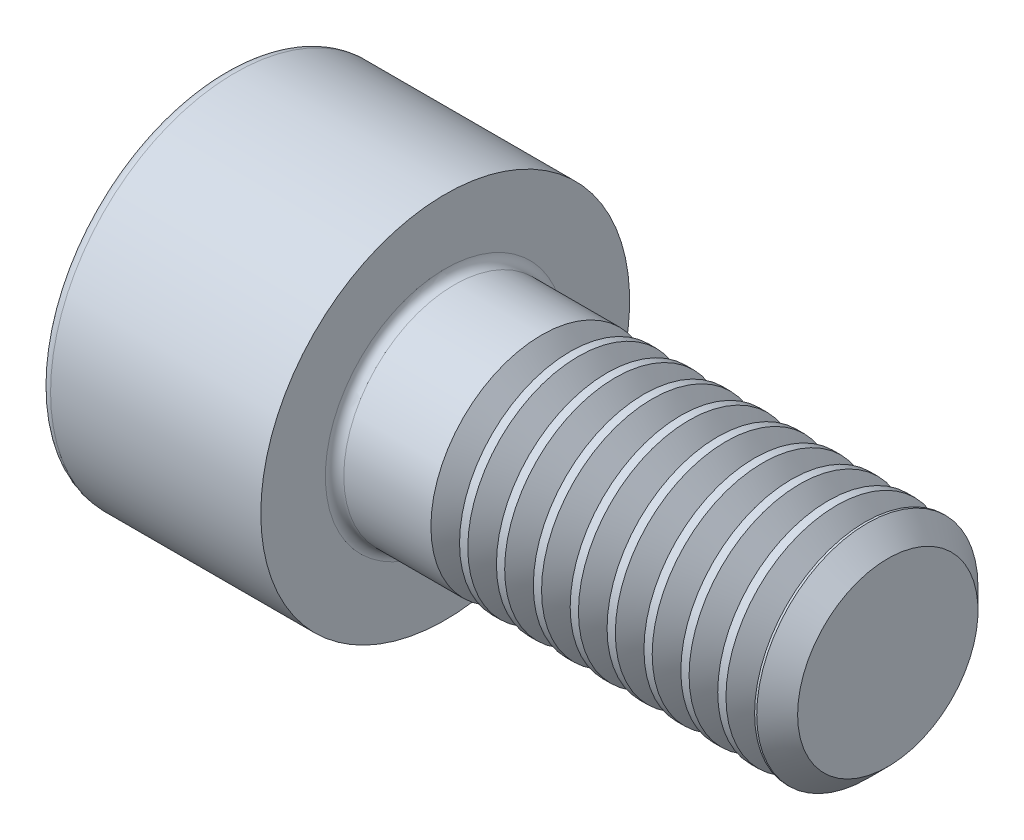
ISO-10303-21;
HEADER;
FILE_DESCRIPTION(('STEP AP214'),'2;1');
FILE_NAME('part.step','',(''),(''),'','','');
FILE_SCHEMA(('AUTOMOTIVE_DESIGN { 1 0 10303 214 1 1 1 1 }'));
ENDSEC;
DATA;
#1=APPLICATION_CONTEXT('core data for automotive mechanical design processes');
#2=APPLICATION_PROTOCOL_DEFINITION('international standard','automotive_design',2000,#1);
#3=PRODUCT_CONTEXT('',#1,'mechanical');
#4=PRODUCT('Part','Part','',(#3));
#5=PRODUCT_RELATED_PRODUCT_CATEGORY('part','',(#4));
#6=PRODUCT_DEFINITION_FORMATION('','',#4);
#7=PRODUCT_DEFINITION_CONTEXT('part definition',#1,'design');
#8=PRODUCT_DEFINITION('design','',#6,#7);
#9=PRODUCT_DEFINITION_SHAPE('','',#8);
#10=(LENGTH_UNIT() NAMED_UNIT(*) SI_UNIT(.MILLI.,.METRE.));
#11=(NAMED_UNIT(*) PLANE_ANGLE_UNIT() SI_UNIT($,.RADIAN.));
#12=(NAMED_UNIT(*) SI_UNIT($,.STERADIAN.) SOLID_ANGLE_UNIT());
#13=UNCERTAINTY_MEASURE_WITH_UNIT(LENGTH_MEASURE(1.E-05),#10,'distance_accuracy_value','');
#14=(GEOMETRIC_REPRESENTATION_CONTEXT(3) GLOBAL_UNCERTAINTY_ASSIGNED_CONTEXT((#13)) GLOBAL_UNIT_ASSIGNED_CONTEXT((#10,
#11,#12)) REPRESENTATION_CONTEXT('',''));
#15=CARTESIAN_POINT('',(0.,0.,0.));
#16=DIRECTION('',(0.,0.,1.));
#17=DIRECTION('',(1.,0.,0.));
#18=AXIS2_PLACEMENT_3D('',#15,#16,#17);
#19=CARTESIAN_POINT('',(0.,0.,0.));
#20=DIRECTION('',(-1.,0.,0.));
#21=DIRECTION('',(0.,0.,1.));
#22=AXIS2_PLACEMENT_3D('',#19,#20,#21);
#23=PLANE('',#22);
#24=DIRECTION('',(0.,-0.499999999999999,0.866025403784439));
#25=VECTOR('',#24,1.);
#26=CARTESIAN_POINT('',(0.,2.93524876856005,0.));
#27=LINE('',#26,#25);
#28=CARTESIAN_POINT('',(0.,2.93524876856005,0.));
#29=VERTEX_POINT('',#28);
#30=CARTESIAN_POINT('',(0.,1.46762438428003,2.542));
#31=VERTEX_POINT('',#30);
#32=EDGE_CURVE('E390',#29,#31,#27,.T.);
#33=ORIENTED_EDGE('',*,*,#32,.T.);
#34=DIRECTION('',(0.,1.,0.));
#35=VECTOR('',#34,1.);
#36=CARTESIAN_POINT('',(0.,-1.46762438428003,2.542));
#37=LINE('',#36,#35);
#38=CARTESIAN_POINT('',(0.,-1.46762438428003,2.542));
#39=VERTEX_POINT('',#38);
#40=EDGE_CURVE('E131',#39,#31,#37,.T.);
#41=ORIENTED_EDGE('',*,*,#40,.F.);
#42=DIRECTION('',(0.,-0.500000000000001,-0.866025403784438));
#43=VECTOR('',#42,1.);
#44=CARTESIAN_POINT('',(0.,-1.46762438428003,2.542));
#45=LINE('',#44,#43);
#46=CARTESIAN_POINT('',(0.,-2.93524876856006,0.));
#47=VERTEX_POINT('',#46);
#48=EDGE_CURVE('E409',#39,#47,#45,.T.);
#49=ORIENTED_EDGE('',*,*,#48,.T.);
#50=DIRECTION('',(0.,0.499999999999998,-0.866025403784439));
#51=VECTOR('',#50,1.);
#52=CARTESIAN_POINT('',(0.,-2.93524876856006,0.));
#53=LINE('',#52,#51);
#54=CARTESIAN_POINT('',(0.,-1.46762438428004,-2.542));
#55=VERTEX_POINT('',#54);
#56=EDGE_CURVE('E412',#47,#55,#53,.T.);
#57=ORIENTED_EDGE('',*,*,#56,.T.);
#58=DIRECTION('',(0.,-1.,0.));
#59=VECTOR('',#58,1.);
#60=CARTESIAN_POINT('',(0.,1.46762438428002,-2.542));
#61=LINE('',#60,#59);
#62=CARTESIAN_POINT('',(0.,1.46762438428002,-2.542));
#63=VERTEX_POINT('',#62);
#64=EDGE_CURVE('E415',#63,#55,#61,.T.);
#65=ORIENTED_EDGE('',*,*,#64,.F.);
#66=DIRECTION('',(0.,-0.500000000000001,-0.866025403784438));
#67=VECTOR('',#66,1.);
#68=CARTESIAN_POINT('',(0.,2.93524876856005,0.));
#69=LINE('',#68,#67);
#70=EDGE_CURVE('E126',#29,#63,#69,.T.);
#71=ORIENTED_EDGE('',*,*,#70,.F.);
#72=EDGE_LOOP('',(#33,#41,#49,#57,#65,#71));
#73=FACE_BOUND('',#72,.T.);
#74=CARTESIAN_POINT('',(0.,0.,0.));
#75=DIRECTION('',(-1.,0.,0.));
#76=DIRECTION('',(0.,0.,1.));
#77=AXIS2_PLACEMENT_3D('',#74,#75,#76);
#78=CIRCLE('',#77,4.7);
#79=CARTESIAN_POINT('',(0.,0.,4.7));
#80=VERTEX_POINT('',#79);
#81=EDGE_CURVE('E43',#80,#80,#78,.T.);
#82=ORIENTED_EDGE('',*,*,#81,.T.);
#83=EDGE_LOOP('',(#82));
#84=FACE_BOUND('',#83,.T.);
#85=ADVANCED_FACE('F35',(#73,#84),#23,.T.);
#86=CARTESIAN_POINT('',(-31.75,0.,0.));
#87=DIRECTION('',(-1.,0.,0.));
#88=DIRECTION('',(0.,0.,1.));
#89=AXIS2_PLACEMENT_3D('',#86,#87,#88);
#90=CYLINDRICAL_SURFACE('',#89,5.);
#91=CARTESIAN_POINT('',(0.300000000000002,0.,0.));
#92=DIRECTION('',(-1.,0.,0.));
#93=DIRECTION('',(0.,0.,1.));
#94=AXIS2_PLACEMENT_3D('',#91,#92,#93);
#95=CIRCLE('',#94,5.);
#96=CARTESIAN_POINT('',(0.300000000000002,0.,5.));
#97=VERTEX_POINT('',#96);
#98=EDGE_CURVE('E11',#97,#97,#95,.F.);
#99=ORIENTED_EDGE('',*,*,#98,.T.);
#100=EDGE_LOOP('',(#99));
#101=FACE_BOUND('',#100,.T.);
#102=CARTESIAN_POINT('',(6.,0.,0.));
#103=DIRECTION('',(-1.,0.,0.));
#104=DIRECTION('',(0.,0.,1.));
#105=AXIS2_PLACEMENT_3D('',#102,#103,#104);
#106=CIRCLE('',#105,5.);
#107=CARTESIAN_POINT('',(6.,0.,5.));
#108=VERTEX_POINT('',#107);
#109=EDGE_CURVE('E149',#108,#108,#106,.T.);
#110=ORIENTED_EDGE('',*,*,#109,.T.);
#111=EDGE_LOOP('',(#110));
#112=FACE_BOUND('',#111,.T.);
#113=ADVANCED_FACE('F173',(#101,#112),#90,.T.);
#114=CARTESIAN_POINT('',(6.,5.,0.));
#115=DIRECTION('',(1.,0.,0.));
#116=DIRECTION('',(0.,0.,-1.));
#117=AXIS2_PLACEMENT_3D('',#114,#115,#116);
#118=PLANE('',#117);
#119=CARTESIAN_POINT('',(6.,0.,0.));
#120=DIRECTION('',(1.,0.,0.));
#121=DIRECTION('',(0.,0.,-1.));
#122=AXIS2_PLACEMENT_3D('',#119,#120,#121);
#123=CIRCLE('',#122,3.24999999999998);
#124=CARTESIAN_POINT('',(6.,0.,-3.24999999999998));
#125=VERTEX_POINT('',#124);
#126=EDGE_CURVE('E152',#125,#125,#123,.F.);
#127=ORIENTED_EDGE('',*,*,#126,.T.);
#128=EDGE_LOOP('',(#127));
#129=FACE_BOUND('',#128,.T.);
#130=ORIENTED_EDGE('',*,*,#109,.F.);
#131=EDGE_LOOP('',(#130));
#132=FACE_BOUND('',#131,.T.);
#133=ADVANCED_FACE('F179',(#129,#132),#118,.T.);
#134=CARTESIAN_POINT('',(-31.75,0.,0.));
#135=DIRECTION('',(-1.,0.,0.));
#136=DIRECTION('',(0.,0.,1.));
#137=AXIS2_PLACEMENT_3D('',#134,#135,#136);
#138=CYLINDRICAL_SURFACE('',#137,2.99999999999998);
#139=CARTESIAN_POINT('',(8.61173492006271,0.,0.));
#140=DIRECTION('',(-1.,0.,0.));
#141=DIRECTION('',(0.,-1.,0.));
#142=AXIS2_PLACEMENT_3D('',#139,#140,#141);
#143=CIRCLE('',#142,3.);
#144=CARTESIAN_POINT('',(8.61173492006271,-3.,0.));
#145=VERTEX_POINT('',#144);
#146=EDGE_CURVE('E385',#145,#145,#143,.T.);
#147=ORIENTED_EDGE('',*,*,#146,.T.);
#148=EDGE_LOOP('',(#147));
#149=FACE_BOUND('',#148,.T.);
#150=CARTESIAN_POINT('',(6.25,0.,0.));
#151=DIRECTION('',(1.,0.,0.));
#152=DIRECTION('',(0.,0.,-1.));
#153=AXIS2_PLACEMENT_3D('',#150,#151,#152);
#154=CIRCLE('',#153,2.99999999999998);
#155=CARTESIAN_POINT('',(6.25,0.,-2.99999999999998));
#156=VERTEX_POINT('',#155);
#157=EDGE_CURVE('E155',#156,#156,#154,.T.);
#158=ORIENTED_EDGE('',*,*,#157,.T.);
#159=EDGE_LOOP('',(#158));
#160=FACE_BOUND('',#159,.T.);
#161=ADVANCED_FACE('F169',(#149,#160),#138,.T.);
#162=CARTESIAN_POINT('',(6.25,0.,0.));
#163=DIRECTION('',(1.,0.,0.));
#164=DIRECTION('',(0.,0.,-1.));
#165=AXIS2_PLACEMENT_3D('',#162,#163,#164);
#166=TOROIDAL_SURFACE('',#165,3.24999999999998,0.25);
#167=ORIENTED_EDGE('',*,*,#157,.F.);
#168=EDGE_LOOP('',(#167));
#169=FACE_BOUND('',#168,.T.);
#170=ORIENTED_EDGE('',*,*,#126,.F.);
#171=EDGE_LOOP('',(#170));
#172=FACE_BOUND('',#171,.T.);
#173=ADVANCED_FACE('F162',(#169,#172),#166,.F.);
#174=CARTESIAN_POINT('',(0.300000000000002,0.,0.));
#175=DIRECTION('',(-1.,0.,0.));
#176=DIRECTION('',(0.,0.,1.));
#177=AXIS2_PLACEMENT_3D('',#174,#175,#176);
#178=TOROIDAL_SURFACE('',#177,4.7,0.3);
#179=ORIENTED_EDGE('',*,*,#98,.F.);
#180=EDGE_LOOP('',(#179));
#181=FACE_BOUND('',#180,.T.);
#182=ORIENTED_EDGE('',*,*,#81,.F.);
#183=EDGE_LOOP('',(#182));
#184=FACE_BOUND('',#183,.T.);
#185=ADVANCED_FACE('F37',(#181,#184),#178,.T.);
#186=CARTESIAN_POINT('',(3.,2.93524876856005,0.));
#187=DIRECTION('',(0.,-0.866025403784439,-0.499999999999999));
#188=DIRECTION('',(0.,0.499999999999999,-0.866025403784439));
#189=AXIS2_PLACEMENT_3D('',#186,#187,#188);
#190=PLANE('',#189);
#191=ORIENTED_EDGE('',*,*,#32,.F.);
#192=DIRECTION('',(-1.,0.,0.));
#193=VECTOR('',#192,1.);
#194=CARTESIAN_POINT('',(3.,2.93524876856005,0.));
#195=LINE('',#194,#193);
#196=CARTESIAN_POINT('',(3.,2.93524876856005,0.));
#197=VERTEX_POINT('',#196);
#198=EDGE_CURVE('E406',#197,#29,#195,.T.);
#199=ORIENTED_EDGE('',*,*,#198,.F.);
#200=DIRECTION('',(0.,-0.499999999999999,0.866025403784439));
#201=VECTOR('',#200,1.);
#202=CARTESIAN_POINT('',(3.,2.93524876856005,0.));
#203=LINE('',#202,#201);
#204=CARTESIAN_POINT('',(3.,2.20143657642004,1.27099999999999));
#205=VERTEX_POINT('',#204);
#206=EDGE_CURVE('E118',#197,#205,#203,.T.);
#207=ORIENTED_EDGE('',*,*,#206,.T.);
#208=CARTESIAN_POINT('',(3.,1.46762438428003,2.542));
#209=VERTEX_POINT('',#208);
#210=EDGE_CURVE('E109',#205,#209,#203,.T.);
#211=ORIENTED_EDGE('',*,*,#210,.T.);
#212=DIRECTION('',(-1.,0.,0.));
#213=VECTOR('',#212,1.);
#214=CARTESIAN_POINT('',(3.,1.46762438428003,2.542));
#215=LINE('',#214,#213);
#216=EDGE_CURVE('E123',#209,#31,#215,.T.);
#217=ORIENTED_EDGE('',*,*,#216,.T.);
#218=EDGE_LOOP('',(#191,#199,#207,#211,#217));
#219=FACE_BOUND('',#218,.T.);
#220=ADVANCED_FACE('F122',(#219),#190,.T.);
#221=CARTESIAN_POINT('',(3.,-1.46762438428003,2.542));
#222=DIRECTION('',(0.,0.,1.));
#223=DIRECTION('',(0.,-1.,0.));
#224=AXIS2_PLACEMENT_3D('',#221,#222,#223);
#225=PLANE('',#224);
#226=ORIENTED_EDGE('',*,*,#40,.T.);
#227=ORIENTED_EDGE('',*,*,#216,.F.);
#228=DIRECTION('',(0.,1.,0.));
#229=VECTOR('',#228,1.);
#230=CARTESIAN_POINT('',(3.,-1.46762438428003,2.542));
#231=LINE('',#230,#229);
#232=CARTESIAN_POINT('',(3.,0.,2.542));
#233=VERTEX_POINT('',#232);
#234=EDGE_CURVE('E106',#233,#209,#231,.T.);
#235=ORIENTED_EDGE('',*,*,#234,.F.);
#236=CARTESIAN_POINT('',(3.,-1.46762438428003,2.542));
#237=VERTEX_POINT('',#236);
#238=EDGE_CURVE('E117',#237,#233,#231,.T.);
#239=ORIENTED_EDGE('',*,*,#238,.F.);
#240=DIRECTION('',(-1.,0.,0.));
#241=VECTOR('',#240,1.);
#242=CARTESIAN_POINT('',(3.,-1.46762438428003,2.542));
#243=LINE('',#242,#241);
#244=EDGE_CURVE('E133',#237,#39,#243,.T.);
#245=ORIENTED_EDGE('',*,*,#244,.T.);
#246=EDGE_LOOP('',(#226,#227,#235,#239,#245));
#247=FACE_BOUND('',#246,.T.);
#248=ADVANCED_FACE('F128',(#247),#225,.F.);
#249=CARTESIAN_POINT('',(3.,-1.46762438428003,2.542));
#250=DIRECTION('',(0.,0.866025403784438,-0.500000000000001));
#251=DIRECTION('',(0.,0.500000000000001,0.866025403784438));
#252=AXIS2_PLACEMENT_3D('',#249,#250,#251);
#253=PLANE('',#252);
#254=ORIENTED_EDGE('',*,*,#48,.F.);
#255=ORIENTED_EDGE('',*,*,#244,.F.);
#256=DIRECTION('',(0.,-0.500000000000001,-0.866025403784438));
#257=VECTOR('',#256,1.);
#258=CARTESIAN_POINT('',(3.,-1.46762438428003,2.542));
#259=LINE('',#258,#257);
#260=CARTESIAN_POINT('',(3.,-2.20143657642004,1.271));
#261=VERTEX_POINT('',#260);
#262=EDGE_CURVE('E393',#237,#261,#259,.T.);
#263=ORIENTED_EDGE('',*,*,#262,.T.);
#264=CARTESIAN_POINT('',(3.,-2.93524876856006,0.));
#265=VERTEX_POINT('',#264);
#266=EDGE_CURVE('E392',#261,#265,#259,.T.);
#267=ORIENTED_EDGE('',*,*,#266,.T.);
#268=DIRECTION('',(-1.,0.,0.));
#269=VECTOR('',#268,1.);
#270=CARTESIAN_POINT('',(3.,-2.93524876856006,0.));
#271=LINE('',#270,#269);
#272=EDGE_CURVE('E138',#265,#47,#271,.T.);
#273=ORIENTED_EDGE('',*,*,#272,.T.);
#274=EDGE_LOOP('',(#254,#255,#263,#267,#273));
#275=FACE_BOUND('',#274,.T.);
#276=ADVANCED_FACE('F207',(#275),#253,.T.);
#277=CARTESIAN_POINT('',(3.,-2.93524876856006,0.));
#278=DIRECTION('',(0.,0.86602540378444,0.499999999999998));
#279=DIRECTION('',(0.,-0.499999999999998,0.86602540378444));
#280=AXIS2_PLACEMENT_3D('',#277,#278,#279);
#281=PLANE('',#280);
#282=ORIENTED_EDGE('',*,*,#56,.F.);
#283=ORIENTED_EDGE('',*,*,#272,.F.);
#284=DIRECTION('',(0.,0.499999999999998,-0.866025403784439));
#285=VECTOR('',#284,1.);
#286=CARTESIAN_POINT('',(3.,-2.93524876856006,0.));
#287=LINE('',#286,#285);
#288=CARTESIAN_POINT('',(3.,-2.20143657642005,-1.271));
#289=VERTEX_POINT('',#288);
#290=EDGE_CURVE('E397',#265,#289,#287,.T.);
#291=ORIENTED_EDGE('',*,*,#290,.T.);
#292=CARTESIAN_POINT('',(3.,-1.46762438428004,-2.542));
#293=VERTEX_POINT('',#292);
#294=EDGE_CURVE('E396',#289,#293,#287,.T.);
#295=ORIENTED_EDGE('',*,*,#294,.T.);
#296=DIRECTION('',(-1.,0.,0.));
#297=VECTOR('',#296,1.);
#298=CARTESIAN_POINT('',(3.,-1.46762438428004,-2.542));
#299=LINE('',#298,#297);
#300=EDGE_CURVE('E424',#293,#55,#299,.T.);
#301=ORIENTED_EDGE('',*,*,#300,.T.);
#302=EDGE_LOOP('',(#282,#283,#291,#295,#301));
#303=FACE_BOUND('',#302,.T.);
#304=ADVANCED_FACE('F210',(#303),#281,.T.);
#305=CARTESIAN_POINT('',(3.,1.46762438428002,-2.542));
#306=DIRECTION('',(0.,0.,-1.));
#307=DIRECTION('',(0.,1.,0.));
#308=AXIS2_PLACEMENT_3D('',#305,#306,#307);
#309=PLANE('',#308);
#310=ORIENTED_EDGE('',*,*,#64,.T.);
#311=ORIENTED_EDGE('',*,*,#300,.F.);
#312=DIRECTION('',(0.,-1.,0.));
#313=VECTOR('',#312,1.);
#314=CARTESIAN_POINT('',(3.,1.46762438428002,-2.542));
#315=LINE('',#314,#313);
#316=CARTESIAN_POINT('',(3.,0.,-2.542));
#317=VERTEX_POINT('',#316);
#318=EDGE_CURVE('E400',#317,#293,#315,.T.);
#319=ORIENTED_EDGE('',*,*,#318,.F.);
#320=CARTESIAN_POINT('',(3.,1.46762438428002,-2.542));
#321=VERTEX_POINT('',#320);
#322=EDGE_CURVE('E50',#321,#317,#315,.T.);
#323=ORIENTED_EDGE('',*,*,#322,.F.);
#324=DIRECTION('',(-1.,0.,0.));
#325=VECTOR('',#324,1.);
#326=CARTESIAN_POINT('',(3.,1.46762438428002,-2.542));
#327=LINE('',#326,#325);
#328=EDGE_CURVE('E421',#321,#63,#327,.T.);
#329=ORIENTED_EDGE('',*,*,#328,.T.);
#330=EDGE_LOOP('',(#310,#311,#319,#323,#329));
#331=FACE_BOUND('',#330,.T.);
#332=ADVANCED_FACE('F214',(#331),#309,.F.);
#333=CARTESIAN_POINT('',(3.,2.93524876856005,0.));
#334=DIRECTION('',(0.,0.866025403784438,-0.500000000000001));
#335=DIRECTION('',(0.,0.500000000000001,0.866025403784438));
#336=AXIS2_PLACEMENT_3D('',#333,#334,#335);
#337=PLANE('',#336);
#338=ORIENTED_EDGE('',*,*,#70,.T.);
#339=ORIENTED_EDGE('',*,*,#328,.F.);
#340=DIRECTION('',(0.,-0.500000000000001,-0.866025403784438));
#341=VECTOR('',#340,1.);
#342=CARTESIAN_POINT('',(3.,2.93524876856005,0.));
#343=LINE('',#342,#341);
#344=CARTESIAN_POINT('',(3.,2.20143657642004,-1.271));
#345=VERTEX_POINT('',#344);
#346=EDGE_CURVE('E402',#345,#321,#343,.T.);
#347=ORIENTED_EDGE('',*,*,#346,.F.);
#348=EDGE_CURVE('E403',#197,#345,#343,.T.);
#349=ORIENTED_EDGE('',*,*,#348,.F.);
#350=ORIENTED_EDGE('',*,*,#198,.T.);
#351=EDGE_LOOP('',(#338,#339,#347,#349,#350));
#352=FACE_BOUND('',#351,.T.);
#353=ADVANCED_FACE('F218',(#352),#337,.F.);
#354=CARTESIAN_POINT('',(3.,4.40287315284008,-2.54200000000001));
#355=DIRECTION('',(1.,0.,0.));
#356=DIRECTION('',(0.,0.,-1.));
#357=AXIS2_PLACEMENT_3D('',#354,#355,#356);
#358=PLANE('',#357);
#359=ORIENTED_EDGE('',*,*,#318,.T.);
#360=ORIENTED_EDGE('',*,*,#294,.F.);
#361=CARTESIAN_POINT('',(3.,0.,0.));
#362=DIRECTION('',(-1.,0.,0.));
#363=DIRECTION('',(0.,0.,1.));
#364=AXIS2_PLACEMENT_3D('',#361,#362,#363);
#365=CIRCLE('',#364,2.542);
#366=EDGE_CURVE('E441',#317,#289,#365,.T.);
#367=ORIENTED_EDGE('',*,*,#366,.F.);
#368=EDGE_LOOP('',(#359,#360,#367));
#369=FACE_BOUND('',#368,.T.);
#370=ADVANCED_FACE('F222',(#369),#358,.F.);
#371=ORIENTED_EDGE('',*,*,#290,.F.);
#372=ORIENTED_EDGE('',*,*,#266,.F.);
#373=EDGE_CURVE('E136',#289,#261,#365,.T.);
#374=ORIENTED_EDGE('',*,*,#373,.F.);
#375=EDGE_LOOP('',(#371,#372,#374));
#376=FACE_BOUND('',#375,.T.);
#377=ADVANCED_FACE('F226',(#376),#358,.F.);
#378=ORIENTED_EDGE('',*,*,#262,.F.);
#379=ORIENTED_EDGE('',*,*,#238,.T.);
#380=EDGE_CURVE('E132',#261,#233,#365,.T.);
#381=ORIENTED_EDGE('',*,*,#380,.F.);
#382=EDGE_LOOP('',(#378,#379,#381));
#383=FACE_BOUND('',#382,.T.);
#384=ADVANCED_FACE('F450',(#383),#358,.F.);
#385=ORIENTED_EDGE('',*,*,#234,.T.);
#386=ORIENTED_EDGE('',*,*,#210,.F.);
#387=EDGE_CURVE('E112',#233,#205,#365,.T.);
#388=ORIENTED_EDGE('',*,*,#387,.F.);
#389=EDGE_LOOP('',(#385,#386,#388));
#390=FACE_BOUND('',#389,.T.);
#391=ADVANCED_FACE('F108',(#390),#358,.F.);
#392=ORIENTED_EDGE('',*,*,#206,.F.);
#393=ORIENTED_EDGE('',*,*,#348,.T.);
#394=EDGE_CURVE('E143',#205,#345,#365,.T.);
#395=ORIENTED_EDGE('',*,*,#394,.F.);
#396=EDGE_LOOP('',(#392,#393,#395));
#397=FACE_BOUND('',#396,.T.);
#398=ADVANCED_FACE('F436',(#397),#358,.F.);
#399=ORIENTED_EDGE('',*,*,#346,.T.);
#400=ORIENTED_EDGE('',*,*,#322,.T.);
#401=EDGE_CURVE('E440',#345,#317,#365,.T.);
#402=ORIENTED_EDGE('',*,*,#401,.F.);
#403=EDGE_LOOP('',(#399,#400,#402));
#404=FACE_BOUND('',#403,.T.);
#405=ADVANCED_FACE('F203',(#404),#358,.F.);
#406=CARTESIAN_POINT('',(3.,0.,0.));
#407=DIRECTION('',(-1.,0.,0.));
#408=DIRECTION('',(0.,0.,1.));
#409=AXIS2_PLACEMENT_3D('',#406,#407,#408);
#410=CONICAL_SURFACE('',#409,2.542,1.04719755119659);
#411=CARTESIAN_POINT('',(4.46762438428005,0.,0.));
#412=VERTEX_POINT('',#411);
#413=VERTEX_LOOP('',#412);
#414=FACE_BOUND('',#413,.T.);
#415=ORIENTED_EDGE('',*,*,#387,.T.);
#416=ORIENTED_EDGE('',*,*,#394,.T.);
#417=ORIENTED_EDGE('',*,*,#401,.T.);
#418=ORIENTED_EDGE('',*,*,#366,.T.);
#419=ORIENTED_EDGE('',*,*,#373,.T.);
#420=ORIENTED_EDGE('',*,*,#380,.T.);
#421=EDGE_LOOP('',(#415,#416,#417,#418,#419,#420));
#422=FACE_BOUND('',#421,.T.);
#423=ADVANCED_FACE('F200',(#414,#422),#410,.F.);
#424=CARTESIAN_POINT('',(9.38826507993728,0.,0.));
#425=DIRECTION('',(1.,0.,0.));
#426=DIRECTION('',(0.,1.,0.));
#427=AXIS2_PLACEMENT_3D('',#424,#425,#426);
#428=CONICAL_SURFACE('',#427,3.,0.959931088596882);
#429=CARTESIAN_POINT('',(9.,0.,0.));
#430=DIRECTION('',(-1.,0.,0.));
#431=DIRECTION('',(0.,-1.,0.));
#432=AXIS2_PLACEMENT_3D('',#429,#430,#431);
#433=CIRCLE('',#432,2.4455);
#434=CARTESIAN_POINT('',(9.,-2.4455,0.));
#435=VERTEX_POINT('',#434);
#436=EDGE_CURVE('E382',#435,#435,#433,.T.);
#437=ORIENTED_EDGE('',*,*,#436,.F.);
#438=EDGE_LOOP('',(#437));
#439=FACE_BOUND('',#438,.T.);
#440=CARTESIAN_POINT('',(9.38826507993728,0.,0.));
#441=DIRECTION('',(-1.,0.,0.));
#442=DIRECTION('',(0.,-1.,0.));
#443=AXIS2_PLACEMENT_3D('',#440,#441,#442);
#444=CIRCLE('',#443,3.);
#445=CARTESIAN_POINT('',(9.38826507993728,-3.,0.));
#446=VERTEX_POINT('',#445);
#447=EDGE_CURVE('E388',#446,#446,#444,.T.);
#448=ORIENTED_EDGE('',*,*,#447,.T.);
#449=EDGE_LOOP('',(#448));
#450=FACE_BOUND('',#449,.T.);
#451=ADVANCED_FACE('F202',(#439,#450),#428,.T.);
#452=CARTESIAN_POINT('',(9.,0.,0.));
#453=DIRECTION('',(-1.,0.,0.));
#454=DIRECTION('',(0.,-1.,0.));
#455=AXIS2_PLACEMENT_3D('',#452,#453,#454);
#456=CONICAL_SURFACE('',#455,2.4455,0.959931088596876);
#457=ORIENTED_EDGE('',*,*,#146,.F.);
#458=EDGE_LOOP('',(#457));
#459=FACE_BOUND('',#458,.T.);
#460=ORIENTED_EDGE('',*,*,#436,.T.);
#461=EDGE_LOOP('',(#460));
#462=FACE_BOUND('',#461,.T.);
#463=ADVANCED_FACE('F230',(#459,#462),#456,.T.);
#464=CARTESIAN_POINT('',(9.61173492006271,0.,0.));
#465=DIRECTION('',(-1.,0.,0.));
#466=DIRECTION('',(0.,-1.,0.));
#467=AXIS2_PLACEMENT_3D('',#464,#465,#466);
#468=CIRCLE('',#467,3.);
#469=CARTESIAN_POINT('',(9.61173492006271,-3.,0.));
#470=VERTEX_POINT('',#469);
#471=EDGE_CURVE('E376',#470,#470,#468,.T.);
#472=ORIENTED_EDGE('',*,*,#471,.T.);
#473=EDGE_LOOP('',(#472));
#474=FACE_BOUND('',#473,.T.);
#475=ORIENTED_EDGE('',*,*,#447,.F.);
#476=EDGE_LOOP('',(#475));
#477=FACE_BOUND('',#476,.T.);
#478=ADVANCED_FACE('F190',(#474,#477),#138,.T.);
#479=CARTESIAN_POINT('',(10.3882650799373,0.,0.));
#480=DIRECTION('',(1.,0.,0.));
#481=DIRECTION('',(0.,1.,0.));
#482=AXIS2_PLACEMENT_3D('',#479,#480,#481);
#483=CONICAL_SURFACE('',#482,3.,0.959931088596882);
#484=CARTESIAN_POINT('',(10.,0.,0.));
#485=DIRECTION('',(-1.,0.,0.));
#486=DIRECTION('',(0.,-1.,0.));
#487=AXIS2_PLACEMENT_3D('',#484,#485,#486);
#488=CIRCLE('',#487,2.4455);
#489=CARTESIAN_POINT('',(10.,-2.4455,0.));
#490=VERTEX_POINT('',#489);
#491=EDGE_CURVE('E373',#490,#490,#488,.T.);
#492=ORIENTED_EDGE('',*,*,#491,.F.);
#493=EDGE_LOOP('',(#492));
#494=FACE_BOUND('',#493,.T.);
#495=CARTESIAN_POINT('',(10.3882650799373,0.,0.));
#496=DIRECTION('',(-1.,0.,0.));
#497=DIRECTION('',(0.,-1.,0.));
#498=AXIS2_PLACEMENT_3D('',#495,#496,#497);
#499=CIRCLE('',#498,3.);
#500=CARTESIAN_POINT('',(10.3882650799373,-3.,0.));
#501=VERTEX_POINT('',#500);
#502=EDGE_CURVE('E379',#501,#501,#499,.T.);
#503=ORIENTED_EDGE('',*,*,#502,.T.);
#504=EDGE_LOOP('',(#503));
#505=FACE_BOUND('',#504,.T.);
#506=ADVANCED_FACE('F235',(#494,#505),#483,.T.);
#507=CARTESIAN_POINT('',(10.,0.,0.));
#508=DIRECTION('',(-1.,0.,0.));
#509=DIRECTION('',(0.,-1.,0.));
#510=AXIS2_PLACEMENT_3D('',#507,#508,#509);
#511=CONICAL_SURFACE('',#510,2.4455,0.959931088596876);
#512=ORIENTED_EDGE('',*,*,#471,.F.);
#513=EDGE_LOOP('',(#512));
#514=FACE_BOUND('',#513,.T.);
#515=ORIENTED_EDGE('',*,*,#491,.T.);
#516=EDGE_LOOP('',(#515));
#517=FACE_BOUND('',#516,.T.);
#518=ADVANCED_FACE('F238',(#514,#517),#511,.T.);
#519=CARTESIAN_POINT('',(10.6117349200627,0.,0.));
#520=DIRECTION('',(-1.,0.,0.));
#521=DIRECTION('',(0.,-1.,0.));
#522=AXIS2_PLACEMENT_3D('',#519,#520,#521);
#523=CIRCLE('',#522,3.);
#524=CARTESIAN_POINT('',(10.6117349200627,-3.,0.));
#525=VERTEX_POINT('',#524);
#526=EDGE_CURVE('E367',#525,#525,#523,.T.);
#527=ORIENTED_EDGE('',*,*,#526,.T.);
#528=EDGE_LOOP('',(#527));
#529=FACE_BOUND('',#528,.T.);
#530=ORIENTED_EDGE('',*,*,#502,.F.);
#531=EDGE_LOOP('',(#530));
#532=FACE_BOUND('',#531,.T.);
#533=ADVANCED_FACE('F242',(#529,#532),#138,.T.);
#534=CARTESIAN_POINT('',(11.3882650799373,0.,0.));
#535=DIRECTION('',(1.,0.,0.));
#536=DIRECTION('',(0.,1.,0.));
#537=AXIS2_PLACEMENT_3D('',#534,#535,#536);
#538=CONICAL_SURFACE('',#537,3.,0.959931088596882);
#539=CARTESIAN_POINT('',(11.,0.,0.));
#540=DIRECTION('',(-1.,0.,0.));
#541=DIRECTION('',(0.,-1.,0.));
#542=AXIS2_PLACEMENT_3D('',#539,#540,#541);
#543=CIRCLE('',#542,2.4455);
#544=CARTESIAN_POINT('',(11.,-2.4455,0.));
#545=VERTEX_POINT('',#544);
#546=EDGE_CURVE('E364',#545,#545,#543,.T.);
#547=ORIENTED_EDGE('',*,*,#546,.F.);
#548=EDGE_LOOP('',(#547));
#549=FACE_BOUND('',#548,.T.);
#550=CARTESIAN_POINT('',(11.3882650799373,0.,0.));
#551=DIRECTION('',(-1.,0.,0.));
#552=DIRECTION('',(0.,-1.,0.));
#553=AXIS2_PLACEMENT_3D('',#550,#551,#552);
#554=CIRCLE('',#553,3.);
#555=CARTESIAN_POINT('',(11.3882650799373,-3.,0.));
#556=VERTEX_POINT('',#555);
#557=EDGE_CURVE('E370',#556,#556,#554,.T.);
#558=ORIENTED_EDGE('',*,*,#557,.T.);
#559=EDGE_LOOP('',(#558));
#560=FACE_BOUND('',#559,.T.);
#561=ADVANCED_FACE('F244',(#549,#560),#538,.T.);
#562=CARTESIAN_POINT('',(11.,0.,0.));
#563=DIRECTION('',(-1.,0.,0.));
#564=DIRECTION('',(0.,-1.,0.));
#565=AXIS2_PLACEMENT_3D('',#562,#563,#564);
#566=CONICAL_SURFACE('',#565,2.4455,0.959931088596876);
#567=ORIENTED_EDGE('',*,*,#526,.F.);
#568=EDGE_LOOP('',(#567));
#569=FACE_BOUND('',#568,.T.);
#570=ORIENTED_EDGE('',*,*,#546,.T.);
#571=EDGE_LOOP('',(#570));
#572=FACE_BOUND('',#571,.T.);
#573=ADVANCED_FACE('F247',(#569,#572),#566,.T.);
#574=CARTESIAN_POINT('',(11.6117349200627,0.,0.));
#575=DIRECTION('',(-1.,0.,0.));
#576=DIRECTION('',(0.,-1.,0.));
#577=AXIS2_PLACEMENT_3D('',#574,#575,#576);
#578=CIRCLE('',#577,3.);
#579=CARTESIAN_POINT('',(11.6117349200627,-3.,0.));
#580=VERTEX_POINT('',#579);
#581=EDGE_CURVE('E358',#580,#580,#578,.T.);
#582=ORIENTED_EDGE('',*,*,#581,.T.);
#583=EDGE_LOOP('',(#582));
#584=FACE_BOUND('',#583,.T.);
#585=ORIENTED_EDGE('',*,*,#557,.F.);
#586=EDGE_LOOP('',(#585));
#587=FACE_BOUND('',#586,.T.);
#588=ADVANCED_FACE('F251',(#584,#587),#138,.T.);
#589=CARTESIAN_POINT('',(12.3882650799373,0.,0.));
#590=DIRECTION('',(1.,0.,0.));
#591=DIRECTION('',(0.,1.,0.));
#592=AXIS2_PLACEMENT_3D('',#589,#590,#591);
#593=CONICAL_SURFACE('',#592,3.,0.959931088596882);
#594=CARTESIAN_POINT('',(12.,0.,0.));
#595=DIRECTION('',(-1.,0.,0.));
#596=DIRECTION('',(0.,-1.,0.));
#597=AXIS2_PLACEMENT_3D('',#594,#595,#596);
#598=CIRCLE('',#597,2.4455);
#599=CARTESIAN_POINT('',(12.,-2.4455,0.));
#600=VERTEX_POINT('',#599);
#601=EDGE_CURVE('E355',#600,#600,#598,.T.);
#602=ORIENTED_EDGE('',*,*,#601,.F.);
#603=EDGE_LOOP('',(#602));
#604=FACE_BOUND('',#603,.T.);
#605=CARTESIAN_POINT('',(12.3882650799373,0.,0.));
#606=DIRECTION('',(-1.,0.,0.));
#607=DIRECTION('',(0.,-1.,0.));
#608=AXIS2_PLACEMENT_3D('',#605,#606,#607);
#609=CIRCLE('',#608,3.);
#610=CARTESIAN_POINT('',(12.3882650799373,-3.,0.));
#611=VERTEX_POINT('',#610);
#612=EDGE_CURVE('E361',#611,#611,#609,.T.);
#613=ORIENTED_EDGE('',*,*,#612,.T.);
#614=EDGE_LOOP('',(#613));
#615=FACE_BOUND('',#614,.T.);
#616=ADVANCED_FACE('F253',(#604,#615),#593,.T.);
#617=CARTESIAN_POINT('',(12.,0.,0.));
#618=DIRECTION('',(-1.,0.,0.));
#619=DIRECTION('',(0.,-1.,0.));
#620=AXIS2_PLACEMENT_3D('',#617,#618,#619);
#621=CONICAL_SURFACE('',#620,2.4455,0.959931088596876);
#622=ORIENTED_EDGE('',*,*,#581,.F.);
#623=EDGE_LOOP('',(#622));
#624=FACE_BOUND('',#623,.T.);
#625=ORIENTED_EDGE('',*,*,#601,.T.);
#626=EDGE_LOOP('',(#625));
#627=FACE_BOUND('',#626,.T.);
#628=ADVANCED_FACE('F256',(#624,#627),#621,.T.);
#629=CARTESIAN_POINT('',(12.6117349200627,0.,0.));
#630=DIRECTION('',(-1.,0.,0.));
#631=DIRECTION('',(0.,-1.,0.));
#632=AXIS2_PLACEMENT_3D('',#629,#630,#631);
#633=CIRCLE('',#632,3.);
#634=CARTESIAN_POINT('',(12.6117349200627,-3.,0.));
#635=VERTEX_POINT('',#634);
#636=EDGE_CURVE('E349',#635,#635,#633,.T.);
#637=ORIENTED_EDGE('',*,*,#636,.T.);
#638=EDGE_LOOP('',(#637));
#639=FACE_BOUND('',#638,.T.);
#640=ORIENTED_EDGE('',*,*,#612,.F.);
#641=EDGE_LOOP('',(#640));
#642=FACE_BOUND('',#641,.T.);
#643=ADVANCED_FACE('F260',(#639,#642),#138,.T.);
#644=CARTESIAN_POINT('',(13.3882650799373,0.,0.));
#645=DIRECTION('',(1.,0.,0.));
#646=DIRECTION('',(0.,1.,0.));
#647=AXIS2_PLACEMENT_3D('',#644,#645,#646);
#648=CONICAL_SURFACE('',#647,3.,0.959931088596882);
#649=CARTESIAN_POINT('',(13.,0.,0.));
#650=DIRECTION('',(-1.,0.,0.));
#651=DIRECTION('',(0.,-1.,0.));
#652=AXIS2_PLACEMENT_3D('',#649,#650,#651);
#653=CIRCLE('',#652,2.4455);
#654=CARTESIAN_POINT('',(13.,-2.4455,0.));
#655=VERTEX_POINT('',#654);
#656=EDGE_CURVE('E346',#655,#655,#653,.T.);
#657=ORIENTED_EDGE('',*,*,#656,.F.);
#658=EDGE_LOOP('',(#657));
#659=FACE_BOUND('',#658,.T.);
#660=CARTESIAN_POINT('',(13.3882650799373,0.,0.));
#661=DIRECTION('',(-1.,0.,0.));
#662=DIRECTION('',(0.,-1.,0.));
#663=AXIS2_PLACEMENT_3D('',#660,#661,#662);
#664=CIRCLE('',#663,3.);
#665=CARTESIAN_POINT('',(13.3882650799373,-3.,0.));
#666=VERTEX_POINT('',#665);
#667=EDGE_CURVE('E352',#666,#666,#664,.T.);
#668=ORIENTED_EDGE('',*,*,#667,.T.);
#669=EDGE_LOOP('',(#668));
#670=FACE_BOUND('',#669,.T.);
#671=ADVANCED_FACE('F262',(#659,#670),#648,.T.);
#672=CARTESIAN_POINT('',(13.,0.,0.));
#673=DIRECTION('',(-1.,0.,0.));
#674=DIRECTION('',(0.,-1.,0.));
#675=AXIS2_PLACEMENT_3D('',#672,#673,#674);
#676=CONICAL_SURFACE('',#675,2.4455,0.959931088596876);
#677=ORIENTED_EDGE('',*,*,#636,.F.);
#678=EDGE_LOOP('',(#677));
#679=FACE_BOUND('',#678,.T.);
#680=ORIENTED_EDGE('',*,*,#656,.T.);
#681=EDGE_LOOP('',(#680));
#682=FACE_BOUND('',#681,.T.);
#683=ADVANCED_FACE('F265',(#679,#682),#676,.T.);
#684=CARTESIAN_POINT('',(13.6117349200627,0.,0.));
#685=DIRECTION('',(-1.,0.,0.));
#686=DIRECTION('',(0.,-1.,0.));
#687=AXIS2_PLACEMENT_3D('',#684,#685,#686);
#688=CIRCLE('',#687,3.);
#689=CARTESIAN_POINT('',(13.6117349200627,-3.,0.));
#690=VERTEX_POINT('',#689);
#691=EDGE_CURVE('E340',#690,#690,#688,.T.);
#692=ORIENTED_EDGE('',*,*,#691,.T.);
#693=EDGE_LOOP('',(#692));
#694=FACE_BOUND('',#693,.T.);
#695=ORIENTED_EDGE('',*,*,#667,.F.);
#696=EDGE_LOOP('',(#695));
#697=FACE_BOUND('',#696,.T.);
#698=ADVANCED_FACE('F269',(#694,#697),#138,.T.);
#699=CARTESIAN_POINT('',(14.3882650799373,0.,0.));
#700=DIRECTION('',(1.,0.,0.));
#701=DIRECTION('',(0.,1.,0.));
#702=AXIS2_PLACEMENT_3D('',#699,#700,#701);
#703=CONICAL_SURFACE('',#702,3.,0.959931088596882);
#704=CARTESIAN_POINT('',(14.,0.,0.));
#705=DIRECTION('',(-1.,0.,0.));
#706=DIRECTION('',(0.,-1.,0.));
#707=AXIS2_PLACEMENT_3D('',#704,#705,#706);
#708=CIRCLE('',#707,2.4455);
#709=CARTESIAN_POINT('',(14.,-2.4455,0.));
#710=VERTEX_POINT('',#709);
#711=EDGE_CURVE('E337',#710,#710,#708,.T.);
#712=ORIENTED_EDGE('',*,*,#711,.F.);
#713=EDGE_LOOP('',(#712));
#714=FACE_BOUND('',#713,.T.);
#715=CARTESIAN_POINT('',(14.3882650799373,0.,0.));
#716=DIRECTION('',(-1.,0.,0.));
#717=DIRECTION('',(0.,-1.,0.));
#718=AXIS2_PLACEMENT_3D('',#715,#716,#717);
#719=CIRCLE('',#718,3.);
#720=CARTESIAN_POINT('',(14.3882650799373,-3.,0.));
#721=VERTEX_POINT('',#720);
#722=EDGE_CURVE('E343',#721,#721,#719,.T.);
#723=ORIENTED_EDGE('',*,*,#722,.T.);
#724=EDGE_LOOP('',(#723));
#725=FACE_BOUND('',#724,.T.);
#726=ADVANCED_FACE('F271',(#714,#725),#703,.T.);
#727=CARTESIAN_POINT('',(14.,0.,0.));
#728=DIRECTION('',(-1.,0.,0.));
#729=DIRECTION('',(0.,-1.,0.));
#730=AXIS2_PLACEMENT_3D('',#727,#728,#729);
#731=CONICAL_SURFACE('',#730,2.4455,0.959931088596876);
#732=ORIENTED_EDGE('',*,*,#691,.F.);
#733=EDGE_LOOP('',(#732));
#734=FACE_BOUND('',#733,.T.);
#735=ORIENTED_EDGE('',*,*,#711,.T.);
#736=EDGE_LOOP('',(#735));
#737=FACE_BOUND('',#736,.T.);
#738=ADVANCED_FACE('F274',(#734,#737),#731,.T.);
#739=CARTESIAN_POINT('',(14.6117349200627,0.,0.));
#740=DIRECTION('',(-1.,0.,0.));
#741=DIRECTION('',(0.,-1.,0.));
#742=AXIS2_PLACEMENT_3D('',#739,#740,#741);
#743=CIRCLE('',#742,3.);
#744=CARTESIAN_POINT('',(14.6117349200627,-3.,0.));
#745=VERTEX_POINT('',#744);
#746=EDGE_CURVE('E331',#745,#745,#743,.T.);
#747=ORIENTED_EDGE('',*,*,#746,.T.);
#748=EDGE_LOOP('',(#747));
#749=FACE_BOUND('',#748,.T.);
#750=ORIENTED_EDGE('',*,*,#722,.F.);
#751=EDGE_LOOP('',(#750));
#752=FACE_BOUND('',#751,.T.);
#753=ADVANCED_FACE('F278',(#749,#752),#138,.T.);
#754=CARTESIAN_POINT('',(15.3882650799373,0.,0.));
#755=DIRECTION('',(1.,0.,0.));
#756=DIRECTION('',(0.,1.,0.));
#757=AXIS2_PLACEMENT_3D('',#754,#755,#756);
#758=CONICAL_SURFACE('',#757,3.,0.959931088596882);
#759=CARTESIAN_POINT('',(15.,0.,0.));
#760=DIRECTION('',(-1.,0.,0.));
#761=DIRECTION('',(0.,-1.,0.));
#762=AXIS2_PLACEMENT_3D('',#759,#760,#761);
#763=CIRCLE('',#762,2.4455);
#764=CARTESIAN_POINT('',(15.,-2.4455,0.));
#765=VERTEX_POINT('',#764);
#766=EDGE_CURVE('E328',#765,#765,#763,.T.);
#767=ORIENTED_EDGE('',*,*,#766,.F.);
#768=EDGE_LOOP('',(#767));
#769=FACE_BOUND('',#768,.T.);
#770=CARTESIAN_POINT('',(15.3882650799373,0.,0.));
#771=DIRECTION('',(-1.,0.,0.));
#772=DIRECTION('',(0.,-1.,0.));
#773=AXIS2_PLACEMENT_3D('',#770,#771,#772);
#774=CIRCLE('',#773,3.);
#775=CARTESIAN_POINT('',(15.3882650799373,-3.,0.));
#776=VERTEX_POINT('',#775);
#777=EDGE_CURVE('E334',#776,#776,#774,.T.);
#778=ORIENTED_EDGE('',*,*,#777,.T.);
#779=EDGE_LOOP('',(#778));
#780=FACE_BOUND('',#779,.T.);
#781=ADVANCED_FACE('F280',(#769,#780),#758,.T.);
#782=CARTESIAN_POINT('',(15.,0.,0.));
#783=DIRECTION('',(-1.,0.,0.));
#784=DIRECTION('',(0.,-1.,0.));
#785=AXIS2_PLACEMENT_3D('',#782,#783,#784);
#786=CONICAL_SURFACE('',#785,2.4455,0.959931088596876);
#787=ORIENTED_EDGE('',*,*,#746,.F.);
#788=EDGE_LOOP('',(#787));
#789=FACE_BOUND('',#788,.T.);
#790=ORIENTED_EDGE('',*,*,#766,.T.);
#791=EDGE_LOOP('',(#790));
#792=FACE_BOUND('',#791,.T.);
#793=ADVANCED_FACE('F283',(#789,#792),#786,.T.);
#794=CARTESIAN_POINT('',(15.6117349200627,0.,0.));
#795=DIRECTION('',(-1.,0.,0.));
#796=DIRECTION('',(0.,-1.,0.));
#797=AXIS2_PLACEMENT_3D('',#794,#795,#796);
#798=CIRCLE('',#797,3.);
#799=CARTESIAN_POINT('',(15.6117349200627,-3.,0.));
#800=VERTEX_POINT('',#799);
#801=EDGE_CURVE('E322',#800,#800,#798,.T.);
#802=ORIENTED_EDGE('',*,*,#801,.T.);
#803=EDGE_LOOP('',(#802));
#804=FACE_BOUND('',#803,.T.);
#805=ORIENTED_EDGE('',*,*,#777,.F.);
#806=EDGE_LOOP('',(#805));
#807=FACE_BOUND('',#806,.T.);
#808=ADVANCED_FACE('F287',(#804,#807),#138,.T.);
#809=CARTESIAN_POINT('',(16.3882650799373,0.,0.));
#810=DIRECTION('',(1.,0.,0.));
#811=DIRECTION('',(0.,1.,0.));
#812=AXIS2_PLACEMENT_3D('',#809,#810,#811);
#813=CONICAL_SURFACE('',#812,3.,0.959931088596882);
#814=CARTESIAN_POINT('',(16.,0.,0.));
#815=DIRECTION('',(-1.,0.,0.));
#816=DIRECTION('',(0.,-1.,0.));
#817=AXIS2_PLACEMENT_3D('',#814,#815,#816);
#818=CIRCLE('',#817,2.4455);
#819=CARTESIAN_POINT('',(16.,-2.4455,0.));
#820=VERTEX_POINT('',#819);
#821=EDGE_CURVE('E319',#820,#820,#818,.T.);
#822=ORIENTED_EDGE('',*,*,#821,.F.);
#823=EDGE_LOOP('',(#822));
#824=FACE_BOUND('',#823,.T.);
#825=CARTESIAN_POINT('',(16.3882650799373,0.,0.));
#826=DIRECTION('',(-1.,0.,0.));
#827=DIRECTION('',(0.,-1.,0.));
#828=AXIS2_PLACEMENT_3D('',#825,#826,#827);
#829=CIRCLE('',#828,3.);
#830=CARTESIAN_POINT('',(16.3882650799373,-3.,0.));
#831=VERTEX_POINT('',#830);
#832=EDGE_CURVE('E325',#831,#831,#829,.T.);
#833=ORIENTED_EDGE('',*,*,#832,.T.);
#834=EDGE_LOOP('',(#833));
#835=FACE_BOUND('',#834,.T.);
#836=ADVANCED_FACE('F289',(#824,#835),#813,.T.);
#837=CARTESIAN_POINT('',(16.,0.,0.));
#838=DIRECTION('',(-1.,0.,0.));
#839=DIRECTION('',(0.,-1.,0.));
#840=AXIS2_PLACEMENT_3D('',#837,#838,#839);
#841=CONICAL_SURFACE('',#840,2.4455,0.959931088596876);
#842=ORIENTED_EDGE('',*,*,#801,.F.);
#843=EDGE_LOOP('',(#842));
#844=FACE_BOUND('',#843,.T.);
#845=ORIENTED_EDGE('',*,*,#821,.T.);
#846=EDGE_LOOP('',(#845));
#847=FACE_BOUND('',#846,.T.);
#848=ADVANCED_FACE('F292',(#844,#847),#841,.T.);
#849=CARTESIAN_POINT('',(16.6117349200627,0.,0.));
#850=DIRECTION('',(-1.,0.,0.));
#851=DIRECTION('',(0.,-1.,0.));
#852=AXIS2_PLACEMENT_3D('',#849,#850,#851);
#853=CIRCLE('',#852,3.);
#854=CARTESIAN_POINT('',(16.6117349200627,-3.,0.));
#855=VERTEX_POINT('',#854);
#856=EDGE_CURVE('E309',#855,#855,#853,.T.);
#857=ORIENTED_EDGE('',*,*,#856,.T.);
#858=EDGE_LOOP('',(#857));
#859=FACE_BOUND('',#858,.T.);
#860=ORIENTED_EDGE('',*,*,#832,.F.);
#861=EDGE_LOOP('',(#860));
#862=FACE_BOUND('',#861,.T.);
#863=ADVANCED_FACE('F296',(#859,#862),#138,.T.);
#864=CARTESIAN_POINT('',(17.3882650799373,0.,0.));
#865=DIRECTION('',(1.,0.,0.));
#866=DIRECTION('',(0.,1.,0.));
#867=AXIS2_PLACEMENT_3D('',#864,#865,#866);
#868=CONICAL_SURFACE('',#867,3.,0.959931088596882);
#869=CARTESIAN_POINT('',(17.,0.,0.));
#870=DIRECTION('',(-1.,0.,0.));
#871=DIRECTION('',(0.,-1.,0.));
#872=AXIS2_PLACEMENT_3D('',#869,#870,#871);
#873=CIRCLE('',#872,2.4455);
#874=CARTESIAN_POINT('',(17.,-2.4455,0.));
#875=VERTEX_POINT('',#874);
#876=EDGE_CURVE('E312',#875,#875,#873,.T.);
#877=ORIENTED_EDGE('',*,*,#876,.F.);
#878=EDGE_LOOP('',(#877));
#879=FACE_BOUND('',#878,.T.);
#880=CARTESIAN_POINT('',(17.3882650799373,0.,0.));
#881=DIRECTION('',(-1.,0.,0.));
#882=DIRECTION('',(0.,-1.,0.));
#883=AXIS2_PLACEMENT_3D('',#880,#881,#882);
#884=CIRCLE('',#883,3.);
#885=CARTESIAN_POINT('',(17.3882650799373,-3.,0.));
#886=VERTEX_POINT('',#885);
#887=EDGE_CURVE('E314',#886,#886,#884,.T.);
#888=ORIENTED_EDGE('',*,*,#887,.T.);
#889=EDGE_LOOP('',(#888));
#890=FACE_BOUND('',#889,.T.);
#891=ADVANCED_FACE('F298',(#879,#890),#868,.T.);
#892=CARTESIAN_POINT('',(17.,0.,0.));
#893=DIRECTION('',(-1.,0.,0.));
#894=DIRECTION('',(0.,-1.,0.));
#895=AXIS2_PLACEMENT_3D('',#892,#893,#894);
#896=CONICAL_SURFACE('',#895,2.4455,0.959931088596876);
#897=ORIENTED_EDGE('',*,*,#856,.F.);
#898=EDGE_LOOP('',(#897));
#899=FACE_BOUND('',#898,.T.);
#900=ORIENTED_EDGE('',*,*,#876,.T.);
#901=EDGE_LOOP('',(#900));
#902=FACE_BOUND('',#901,.T.);
#903=ADVANCED_FACE('F198',(#899,#902),#896,.T.);
#904=CARTESIAN_POINT('',(18.,2.4455,0.));
#905=DIRECTION('',(1.,0.,0.));
#906=DIRECTION('',(0.,0.,-1.));
#907=AXIS2_PLACEMENT_3D('',#904,#905,#906);
#908=PLANE('',#907);
#909=CARTESIAN_POINT('',(18.,0.,0.));
#910=DIRECTION('',(-1.,0.,0.));
#911=DIRECTION('',(0.,0.,1.));
#912=AXIS2_PLACEMENT_3D('',#909,#910,#911);
#913=CIRCLE('',#912,2.4455);
#914=CARTESIAN_POINT('',(18.,0.,2.4455));
#915=VERTEX_POINT('',#914);
#916=EDGE_CURVE('E142',#915,#915,#913,.T.);
#917=ORIENTED_EDGE('',*,*,#916,.F.);
#918=EDGE_LOOP('',(#917));
#919=FACE_BOUND('',#918,.T.);
#920=ADVANCED_FACE('F194',(#919),#908,.T.);
#921=CARTESIAN_POINT('',(18.,0.,0.));
#922=DIRECTION('',(-1.,0.,0.));
#923=DIRECTION('',(0.,0.,1.));
#924=AXIS2_PLACEMENT_3D('',#921,#922,#923);
#925=CONICAL_SURFACE('',#924,2.4455,0.78539816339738);
#926=CARTESIAN_POINT('',(17.4455,0.,0.));
#927=DIRECTION('',(-1.,0.,0.));
#928=DIRECTION('',(0.,0.,1.));
#929=AXIS2_PLACEMENT_3D('',#926,#927,#928);
#930=CIRCLE('',#929,2.99999999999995);
#931=CARTESIAN_POINT('',(17.4455,0.,2.99999999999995));
#932=VERTEX_POINT('',#931);
#933=EDGE_CURVE('E146',#932,#932,#930,.T.);
#934=ORIENTED_EDGE('',*,*,#933,.F.);
#935=EDGE_LOOP('',(#934));
#936=FACE_BOUND('',#935,.T.);
#937=ORIENTED_EDGE('',*,*,#916,.T.);
#938=EDGE_LOOP('',(#937));
#939=FACE_BOUND('',#938,.T.);
#940=ADVANCED_FACE('F191',(#936,#939),#925,.T.);
#941=ORIENTED_EDGE('',*,*,#887,.F.);
#942=EDGE_LOOP('',(#941));
#943=FACE_BOUND('',#942,.T.);
#944=ORIENTED_EDGE('',*,*,#933,.T.);
#945=EDGE_LOOP('',(#944));
#946=FACE_BOUND('',#945,.T.);
#947=ADVANCED_FACE('F189',(#943,#946),#138,.T.);
#948=CLOSED_SHELL('',(#85,#113,#133,#161,#173,#185,#220,#248,#276,#304,#332,#353,#370,#377,#384,
#391,#398,#405,#423,#451,#463,#478,#506,#518,#533,#561,#573,#588,#616,#628,#643,#671,#683,#698,
#726,#738,#753,#781,#793,#808,#836,#848,#863,#891,#903,#920,#940,#947));
#949=MANIFOLD_SOLID_BREP('B2',#948);
#950=ADVANCED_BREP_SHAPE_REPRESENTATION('',(#18,#949),#14);
#951=SHAPE_DEFINITION_REPRESENTATION(#9,#950);
ENDSEC;
END-ISO-10303-21;
